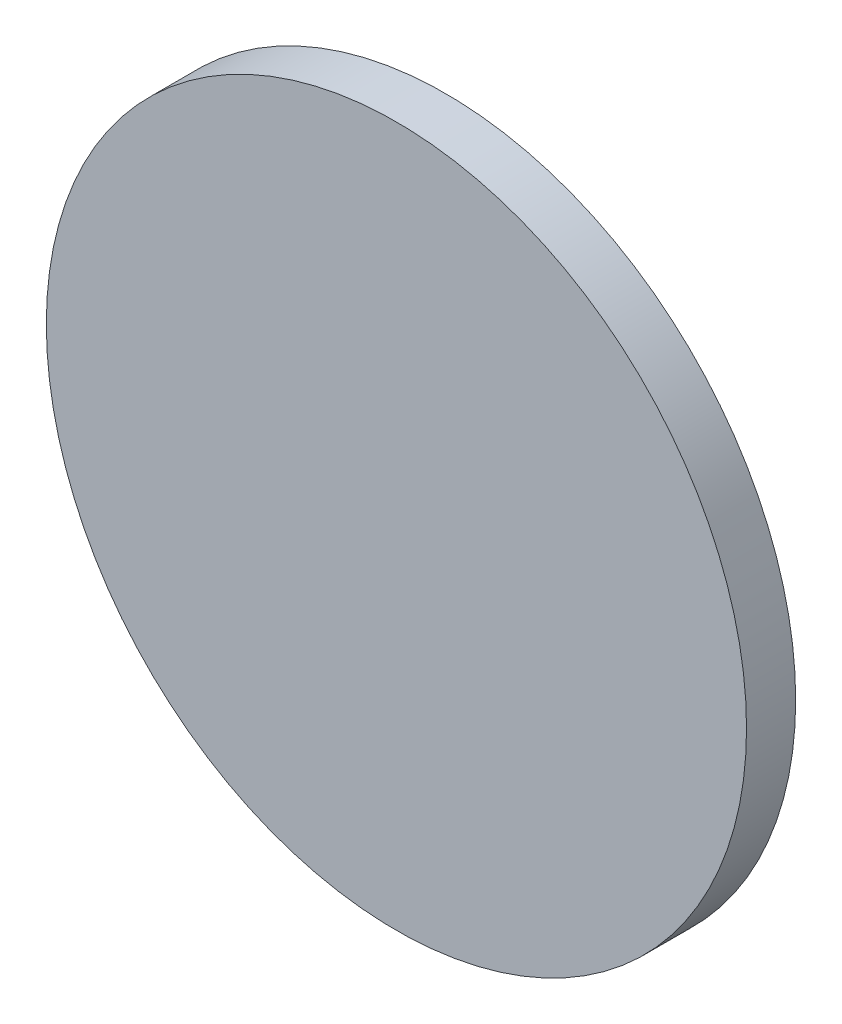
ISO-10303-21;
HEADER;
FILE_DESCRIPTION(('STEP AP214'),'2;1');
FILE_NAME('part.step','',(''),(''),'','','');
FILE_SCHEMA(('AUTOMOTIVE_DESIGN { 1 0 10303 214 1 1 1 1 }'));
ENDSEC;
DATA;
#1=APPLICATION_CONTEXT('core data for automotive mechanical design processes');
#2=APPLICATION_PROTOCOL_DEFINITION('international standard','automotive_design',2000,#1);
#3=PRODUCT_CONTEXT('',#1,'mechanical');
#4=PRODUCT('Part','Part','',(#3));
#5=PRODUCT_RELATED_PRODUCT_CATEGORY('part','',(#4));
#6=PRODUCT_DEFINITION_FORMATION('','',#4);
#7=PRODUCT_DEFINITION_CONTEXT('part definition',#1,'design');
#8=PRODUCT_DEFINITION('design','',#6,#7);
#9=PRODUCT_DEFINITION_SHAPE('','',#8);
#10=(LENGTH_UNIT() NAMED_UNIT(*) SI_UNIT(.MILLI.,.METRE.));
#11=(NAMED_UNIT(*) PLANE_ANGLE_UNIT() SI_UNIT($,.RADIAN.));
#12=(NAMED_UNIT(*) SI_UNIT($,.STERADIAN.) SOLID_ANGLE_UNIT());
#13=UNCERTAINTY_MEASURE_WITH_UNIT(LENGTH_MEASURE(1.E-05),#10,'distance_accuracy_value','');
#14=(GEOMETRIC_REPRESENTATION_CONTEXT(3) GLOBAL_UNCERTAINTY_ASSIGNED_CONTEXT((#13)) GLOBAL_UNIT_ASSIGNED_CONTEXT((#10,
#11,#12)) REPRESENTATION_CONTEXT('',''));
#15=CARTESIAN_POINT('',(0.,0.,0.));
#16=DIRECTION('',(0.,0.,1.));
#17=DIRECTION('',(1.,0.,0.));
#18=AXIS2_PLACEMENT_3D('',#15,#16,#17);
#19=CARTESIAN_POINT('',(0.,0.,8.));
#20=DIRECTION('',(0.,0.,-1.));
#21=DIRECTION('',(-1.,0.,0.));
#22=AXIS2_PLACEMENT_3D('',#19,#20,#21);
#23=CYLINDRICAL_SURFACE('',#22,37.5);
#24=CARTESIAN_POINT('',(0.,0.,8.));
#25=DIRECTION('',(0.,0.,1.));
#26=DIRECTION('',(1.,0.,0.));
#27=AXIS2_PLACEMENT_3D('',#24,#25,#26);
#28=CIRCLE('',#27,37.5);
#29=CARTESIAN_POINT('',(37.5,0.,8.));
#30=VERTEX_POINT('',#29);
#31=EDGE_CURVE('E10',#30,#30,#28,.T.);
#32=ORIENTED_EDGE('',*,*,#31,.F.);
#33=EDGE_LOOP('',(#32));
#34=FACE_BOUND('',#33,.T.);
#35=CARTESIAN_POINT('',(0.,0.,2.73555194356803));
#36=DIRECTION('',(0.,0.,1.));
#37=DIRECTION('',(1.,0.,0.));
#38=AXIS2_PLACEMENT_3D('',#35,#36,#37);
#39=CIRCLE('',#38,37.5);
#40=CARTESIAN_POINT('',(37.5,0.,2.73555194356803));
#41=VERTEX_POINT('',#40);
#42=EDGE_CURVE('E42',#41,#41,#39,.T.);
#43=ORIENTED_EDGE('',*,*,#42,.T.);
#44=EDGE_LOOP('',(#43));
#45=FACE_BOUND('',#44,.T.);
#46=ADVANCED_FACE('F34',(#34,#45),#23,.T.);
#47=CARTESIAN_POINT('',(0.,0.,8.));
#48=DIRECTION('',(0.,0.,1.));
#49=DIRECTION('',(1.,0.,0.));
#50=AXIS2_PLACEMENT_3D('',#47,#48,#49);
#51=PLANE('',#50);
#52=ORIENTED_EDGE('',*,*,#31,.T.);
#53=EDGE_LOOP('',(#52));
#54=FACE_BOUND('',#53,.T.);
#55=ADVANCED_FACE('F54',(#54),#51,.T.);
#56=CARTESIAN_POINT('',(0.,0.,258.4));
#57=DIRECTION('',(0.,-1.,0.));
#58=DIRECTION('',(0.,0.,-1.));
#59=AXIS2_PLACEMENT_3D('',#56,#57,#58);
#60=SPHERICAL_SURFACE('',#59,258.4);
#61=ORIENTED_EDGE('',*,*,#42,.F.);
#62=EDGE_LOOP('',(#61));
#63=FACE_BOUND('',#62,.T.);
#64=ADVANCED_FACE('F36',(#63),#60,.T.);
#65=CLOSED_SHELL('',(#46,#55,#64));
#66=MANIFOLD_SOLID_BREP('B2',#65);
#67=ADVANCED_BREP_SHAPE_REPRESENTATION('',(#18,#66),#14);
#68=SHAPE_DEFINITION_REPRESENTATION(#9,#67);
ENDSEC;
END-ISO-10303-21;
